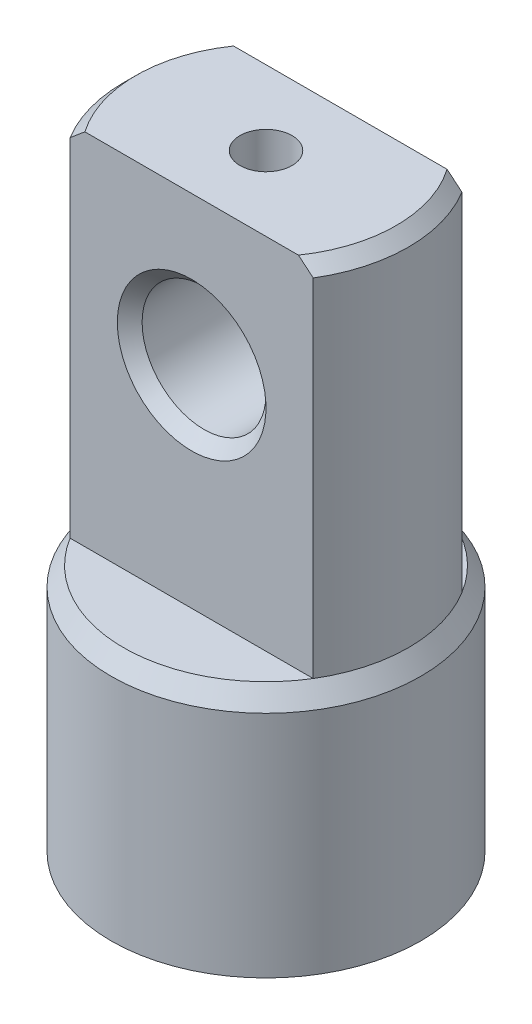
from build123d import *

# Parameters (mm, degrees)
CUT_EXTRUDE3_DEPTH         = 29
CHAMFER1_SIZE              = 1
F_10_0_10_DIAMETER_HOLE1_D = 10
CHAMFER2_SIZE              = 1
M5_TAPPED_HOLE1_REACH      = 54.091
M5_TAPPED_HOLE1_BORE_R     = 2.1


with BuildPart() as part:
    # Sketch1 → Revolve1 (revolve)
    with BuildSketch(Plane.XY, mode=Mode.PRIVATE) as revolve1_sk:
        Polygon((0, 0), (12.5, 0), (12.5, 18.5), (11.5, 20), (11.5, 49), (0, 49), align=None)
    revolve(revolve1_sk.sketch.rotate(Axis((0, 0, 0), (0, 1, 0)), 90), axis=Axis((0, 0, 0), (0, 1, 0)))

    # Sketch3 → Cut-Extrude3 (cut)
    with BuildSketch(Plane(origin=(0, 49, 0), x_dir=(-1, 0, 0), z_dir=(0, 1, 0))):
        with BuildLine():
            Line((10.9658561, -6), (-10.9658561, -6))
            ThreePointArc((-10.9658561, -6), (0, -12.5), (10.9658561, -6))
        make_face()
        with BuildLine():
            Line((10.9658561, 6), (-10.9658561, 6))
            ThreePointArc((-10.9658561, 6), (0, 12.5), (10.9658561, 6))
        make_face()
    extrude(amount=-CUT_EXTRUDE3_DEPTH, mode=Mode.SUBTRACT)

    # Chamfer1
    chamfer1_edges = [part.edges().sort_by_distance(p)[0] for p in [
        (-11.5, 49, 0),
        (11.5, 49, 0),
    ]]
    chamfer(chamfer1_edges, length=CHAMFER1_SIZE)

    # 10.0 _10_ Diameter Hole1 (through all)
    with Locations(Plane.XY.offset(6)):
        with Locations((0, 37)):
            Hole(F_10_0_10_DIAMETER_HOLE1_D / 2)

    # Chamfer2
    chamfer2_edges = [part.edges().sort_by_distance(p)[0] for p in [
        (5, 37, 6),
        (5, 37, -6),
    ]]
    chamfer(chamfer2_edges, length=CHAMFER2_SIZE)

    # M5 Tapped Hole1 bore → M5 Tapped Hole1 (cut, up to next)
    with BuildSketch(Plane(origin=(0, 49, 0), x_dir=(-1, 0, 0), z_dir=(0, 1, 0)), mode=Mode.PRIVATE) as m5_tapped_hole1_sk1:
        Circle(M5_TAPPED_HOLE1_BORE_R)
    m5_tapped_hole1_tool1 = extrude(m5_tapped_hole1_sk1.sketch, amount=-M5_TAPPED_HOLE1_REACH, mode=Mode.PRIVATE) & part.part
    add(m5_tapped_hole1_tool1.solids().sort_by_distance((0, 49, 0))[0], mode=Mode.SUBTRACT)


solid = part.part
